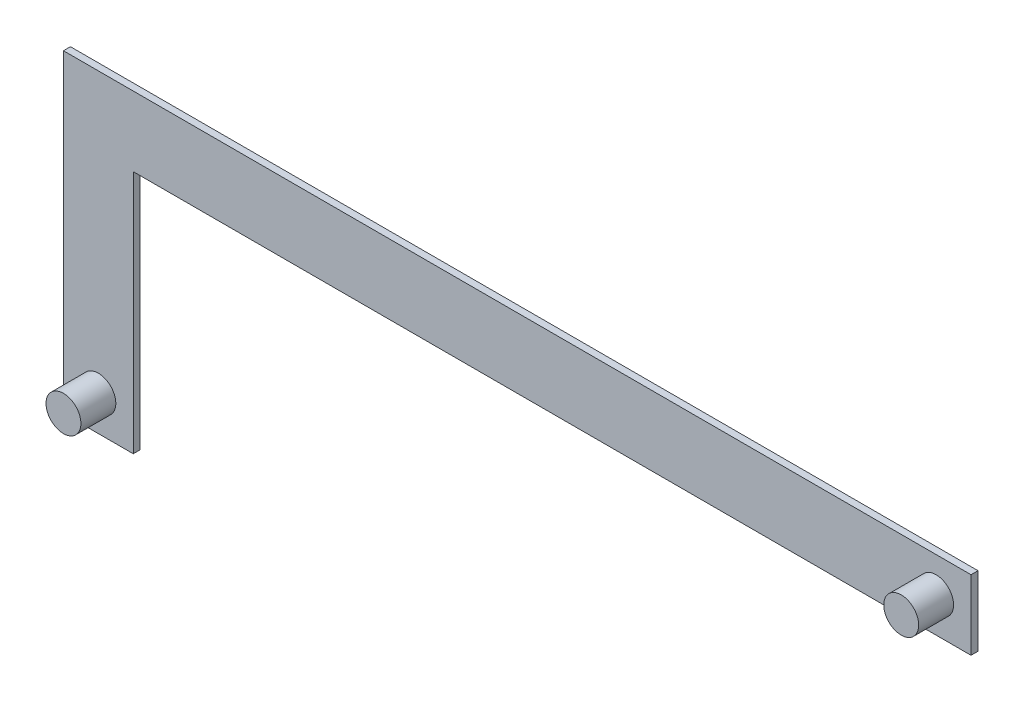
ISO-10303-21;
HEADER;
FILE_DESCRIPTION(('STEP AP214'),'2;1');
FILE_NAME('part.step','',(''),(''),'','','');
FILE_SCHEMA(('AUTOMOTIVE_DESIGN { 1 0 10303 214 1 1 1 1 }'));
ENDSEC;
DATA;
#1=APPLICATION_CONTEXT('core data for automotive mechanical design processes');
#2=APPLICATION_PROTOCOL_DEFINITION('international standard','automotive_design',2000,#1);
#3=PRODUCT_CONTEXT('',#1,'mechanical');
#4=PRODUCT('Part','Part','',(#3));
#5=PRODUCT_RELATED_PRODUCT_CATEGORY('part','',(#4));
#6=PRODUCT_DEFINITION_FORMATION('','',#4);
#7=PRODUCT_DEFINITION_CONTEXT('part definition',#1,'design');
#8=PRODUCT_DEFINITION('design','',#6,#7);
#9=PRODUCT_DEFINITION_SHAPE('','',#8);
#10=(LENGTH_UNIT() NAMED_UNIT(*) SI_UNIT(.MILLI.,.METRE.));
#11=(NAMED_UNIT(*) PLANE_ANGLE_UNIT() SI_UNIT($,.RADIAN.));
#12=(NAMED_UNIT(*) SI_UNIT($,.STERADIAN.) SOLID_ANGLE_UNIT());
#13=UNCERTAINTY_MEASURE_WITH_UNIT(LENGTH_MEASURE(1.E-05),#10,'distance_accuracy_value','');
#14=(GEOMETRIC_REPRESENTATION_CONTEXT(3) GLOBAL_UNCERTAINTY_ASSIGNED_CONTEXT((#13)) GLOBAL_UNIT_ASSIGNED_CONTEXT((#10,
#11,#12)) REPRESENTATION_CONTEXT('',''));
#15=CARTESIAN_POINT('',(0.,0.,0.));
#16=DIRECTION('',(0.,0.,1.));
#17=DIRECTION('',(1.,0.,0.));
#18=AXIS2_PLACEMENT_3D('',#15,#16,#17);
#19=CARTESIAN_POINT('',(125.,-5.,0.));
#20=DIRECTION('',(0.,0.,-1.));
#21=DIRECTION('',(-1.,0.,0.));
#22=AXIS2_PLACEMENT_3D('',#19,#20,#21);
#23=PLANE('',#22);
#24=CARTESIAN_POINT('',(0.,0.,0.));
#25=DIRECTION('',(0.,0.,-1.));
#26=DIRECTION('',(-1.,0.,0.));
#27=AXIS2_PLACEMENT_3D('',#24,#25,#26);
#28=CIRCLE('',#27,2.5);
#29=CARTESIAN_POINT('',(-2.5,0.,0.));
#30=VERTEX_POINT('',#29);
#31=EDGE_CURVE('E101',#30,#30,#28,.T.);
#32=ORIENTED_EDGE('',*,*,#31,.T.);
#33=EDGE_LOOP('',(#32));
#34=FACE_BOUND('',#33,.T.);
#35=DIRECTION('',(0.,-1.,0.));
#36=VECTOR('',#35,1.);
#37=CARTESIAN_POINT('',(125.,40.,0.));
#38=LINE('',#37,#36);
#39=CARTESIAN_POINT('',(125.,40.,0.));
#40=VERTEX_POINT('',#39);
#41=CARTESIAN_POINT('',(125.,30.,0.));
#42=VERTEX_POINT('',#41);
#43=EDGE_CURVE('E88',#40,#42,#38,.T.);
#44=ORIENTED_EDGE('',*,*,#43,.F.);
#45=DIRECTION('',(1.,0.,0.));
#46=VECTOR('',#45,1.);
#47=CARTESIAN_POINT('',(125.,40.,0.));
#48=LINE('',#47,#46);
#49=CARTESIAN_POINT('',(-5.,40.,0.));
#50=VERTEX_POINT('',#49);
#51=EDGE_CURVE('E117',#50,#40,#48,.T.);
#52=ORIENTED_EDGE('',*,*,#51,.F.);
#53=DIRECTION('',(0.,1.,0.));
#54=VECTOR('',#53,1.);
#55=CARTESIAN_POINT('',(-5.,40.,0.));
#56=LINE('',#55,#54);
#57=CARTESIAN_POINT('',(-5.,-5.,0.));
#58=VERTEX_POINT('',#57);
#59=EDGE_CURVE('E115',#58,#50,#56,.T.);
#60=ORIENTED_EDGE('',*,*,#59,.F.);
#61=DIRECTION('',(-1.,0.,0.));
#62=VECTOR('',#61,1.);
#63=CARTESIAN_POINT('',(5.,-5.,0.));
#64=LINE('',#63,#62);
#65=CARTESIAN_POINT('',(5.,-5.,0.));
#66=VERTEX_POINT('',#65);
#67=EDGE_CURVE('E113',#66,#58,#64,.T.);
#68=ORIENTED_EDGE('',*,*,#67,.F.);
#69=DIRECTION('',(0.,-1.,0.));
#70=VECTOR('',#69,1.);
#71=CARTESIAN_POINT('',(5.,-5.,0.));
#72=LINE('',#71,#70);
#73=CARTESIAN_POINT('',(5.00000000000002,30.,0.));
#74=VERTEX_POINT('',#73);
#75=EDGE_CURVE('E90',#74,#66,#72,.T.);
#76=ORIENTED_EDGE('',*,*,#75,.F.);
#77=DIRECTION('',(-1.,0.,0.));
#78=VECTOR('',#77,1.);
#79=CARTESIAN_POINT('',(125.,30.,0.));
#80=LINE('',#79,#78);
#81=EDGE_CURVE('E83',#42,#74,#80,.T.);
#82=ORIENTED_EDGE('',*,*,#81,.F.);
#83=EDGE_LOOP('',(#44,#52,#60,#68,#76,#82));
#84=FACE_BOUND('',#83,.T.);
#85=CARTESIAN_POINT('',(120.,35.,0.));
#86=DIRECTION('',(0.,0.,-1.));
#87=DIRECTION('',(-1.,0.,0.));
#88=AXIS2_PLACEMENT_3D('',#85,#86,#87);
#89=CIRCLE('',#88,2.50000000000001);
#90=CARTESIAN_POINT('',(117.5,35.,0.));
#91=VERTEX_POINT('',#90);
#92=EDGE_CURVE('E11',#91,#91,#89,.F.);
#93=ORIENTED_EDGE('',*,*,#92,.F.);
#94=EDGE_LOOP('',(#93));
#95=FACE_BOUND('',#94,.T.);
#96=ADVANCED_FACE('F30',(#34,#84,#95),#23,.F.);
#97=CARTESIAN_POINT('',(0.,0.,5.));
#98=DIRECTION('',(0.,0.,-1.));
#99=DIRECTION('',(-1.,0.,0.));
#100=AXIS2_PLACEMENT_3D('',#97,#98,#99);
#101=CYLINDRICAL_SURFACE('',#100,2.5);
#102=CARTESIAN_POINT('',(0.,0.,5.));
#103=DIRECTION('',(0.,0.,1.));
#104=DIRECTION('',(1.,0.,0.));
#105=AXIS2_PLACEMENT_3D('',#102,#103,#104);
#106=CIRCLE('',#105,2.5);
#107=CARTESIAN_POINT('',(2.5,0.,5.));
#108=VERTEX_POINT('',#107);
#109=EDGE_CURVE('E38',#108,#108,#106,.T.);
#110=ORIENTED_EDGE('',*,*,#109,.F.);
#111=EDGE_LOOP('',(#110));
#112=FACE_BOUND('',#111,.T.);
#113=ORIENTED_EDGE('',*,*,#31,.F.);
#114=EDGE_LOOP('',(#113));
#115=FACE_BOUND('',#114,.T.);
#116=ADVANCED_FACE('F32',(#112,#115),#101,.T.);
#117=CARTESIAN_POINT('',(0.,0.,5.));
#118=DIRECTION('',(0.,0.,1.));
#119=DIRECTION('',(1.,0.,0.));
#120=AXIS2_PLACEMENT_3D('',#117,#118,#119);
#121=PLANE('',#120);
#122=ORIENTED_EDGE('',*,*,#109,.T.);
#123=EDGE_LOOP('',(#122));
#124=FACE_BOUND('',#123,.T.);
#125=ADVANCED_FACE('F143',(#124),#121,.T.);
#126=CARTESIAN_POINT('',(125.,40.,-1.));
#127=DIRECTION('',(-1.,0.,0.));
#128=DIRECTION('',(0.,0.,1.));
#129=AXIS2_PLACEMENT_3D('',#126,#127,#128);
#130=PLANE('',#129);
#131=ORIENTED_EDGE('',*,*,#43,.T.);
#132=DIRECTION('',(0.,0.,1.));
#133=VECTOR('',#132,1.);
#134=CARTESIAN_POINT('',(125.,30.,-1.));
#135=LINE('',#134,#133);
#136=CARTESIAN_POINT('',(125.,30.,-1.));
#137=VERTEX_POINT('',#136);
#138=EDGE_CURVE('E96',#137,#42,#135,.T.);
#139=ORIENTED_EDGE('',*,*,#138,.F.);
#140=DIRECTION('',(0.,-1.,0.));
#141=VECTOR('',#140,1.);
#142=CARTESIAN_POINT('',(125.,40.,-1.));
#143=LINE('',#142,#141);
#144=CARTESIAN_POINT('',(125.,40.,-1.));
#145=VERTEX_POINT('',#144);
#146=EDGE_CURVE('E119',#145,#137,#143,.T.);
#147=ORIENTED_EDGE('',*,*,#146,.F.);
#148=DIRECTION('',(0.,0.,1.));
#149=VECTOR('',#148,1.);
#150=CARTESIAN_POINT('',(125.,40.,-1.));
#151=LINE('',#150,#149);
#152=EDGE_CURVE('E106',#145,#40,#151,.T.);
#153=ORIENTED_EDGE('',*,*,#152,.T.);
#154=EDGE_LOOP('',(#131,#139,#147,#153));
#155=FACE_BOUND('',#154,.T.);
#156=ADVANCED_FACE('F105',(#155),#130,.F.);
#157=CARTESIAN_POINT('',(125.,30.,-1.));
#158=DIRECTION('',(0.,1.,0.));
#159=DIRECTION('',(-1.,0.,0.));
#160=AXIS2_PLACEMENT_3D('',#157,#158,#159);
#161=PLANE('',#160);
#162=ORIENTED_EDGE('',*,*,#81,.T.);
#163=DIRECTION('',(0.,0.,1.));
#164=VECTOR('',#163,1.);
#165=CARTESIAN_POINT('',(5.00000000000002,30.,-1.));
#166=LINE('',#165,#164);
#167=CARTESIAN_POINT('',(5.00000000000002,30.,-1.));
#168=VERTEX_POINT('',#167);
#169=EDGE_CURVE('E102',#168,#74,#166,.T.);
#170=ORIENTED_EDGE('',*,*,#169,.F.);
#171=DIRECTION('',(-1.,0.,0.));
#172=VECTOR('',#171,1.);
#173=CARTESIAN_POINT('',(125.,30.,-1.));
#174=LINE('',#173,#172);
#175=EDGE_CURVE('E98',#137,#168,#174,.T.);
#176=ORIENTED_EDGE('',*,*,#175,.F.);
#177=ORIENTED_EDGE('',*,*,#138,.T.);
#178=EDGE_LOOP('',(#162,#170,#176,#177));
#179=FACE_BOUND('',#178,.T.);
#180=ADVANCED_FACE('F97',(#179),#161,.F.);
#181=CARTESIAN_POINT('',(5.,-5.,-1.));
#182=DIRECTION('',(-1.,0.,0.));
#183=DIRECTION('',(0.,-1.,0.));
#184=AXIS2_PLACEMENT_3D('',#181,#182,#183);
#185=PLANE('',#184);
#186=ORIENTED_EDGE('',*,*,#75,.T.);
#187=DIRECTION('',(0.,0.,1.));
#188=VECTOR('',#187,1.);
#189=CARTESIAN_POINT('',(5.,-5.,-1.));
#190=LINE('',#189,#188);
#191=CARTESIAN_POINT('',(5.,-5.,-1.));
#192=VERTEX_POINT('',#191);
#193=EDGE_CURVE('E135',#192,#66,#190,.T.);
#194=ORIENTED_EDGE('',*,*,#193,.F.);
#195=DIRECTION('',(0.,-1.,0.));
#196=VECTOR('',#195,1.);
#197=CARTESIAN_POINT('',(5.,-5.,-1.));
#198=LINE('',#197,#196);
#199=EDGE_CURVE('E122',#168,#192,#198,.T.);
#200=ORIENTED_EDGE('',*,*,#199,.F.);
#201=ORIENTED_EDGE('',*,*,#169,.T.);
#202=EDGE_LOOP('',(#186,#194,#200,#201));
#203=FACE_BOUND('',#202,.T.);
#204=ADVANCED_FACE('F171',(#203),#185,.F.);
#205=CARTESIAN_POINT('',(5.,-5.,-1.));
#206=DIRECTION('',(0.,1.,0.));
#207=DIRECTION('',(0.,0.,1.));
#208=AXIS2_PLACEMENT_3D('',#205,#206,#207);
#209=PLANE('',#208);
#210=ORIENTED_EDGE('',*,*,#67,.T.);
#211=DIRECTION('',(0.,0.,1.));
#212=VECTOR('',#211,1.);
#213=CARTESIAN_POINT('',(-5.,-5.,-1.));
#214=LINE('',#213,#212);
#215=CARTESIAN_POINT('',(-5.,-5.,-1.));
#216=VERTEX_POINT('',#215);
#217=EDGE_CURVE('E132',#216,#58,#214,.T.);
#218=ORIENTED_EDGE('',*,*,#217,.F.);
#219=DIRECTION('',(-1.,0.,0.));
#220=VECTOR('',#219,1.);
#221=CARTESIAN_POINT('',(5.,-5.,-1.));
#222=LINE('',#221,#220);
#223=EDGE_CURVE('E124',#192,#216,#222,.T.);
#224=ORIENTED_EDGE('',*,*,#223,.F.);
#225=ORIENTED_EDGE('',*,*,#193,.T.);
#226=EDGE_LOOP('',(#210,#218,#224,#225));
#227=FACE_BOUND('',#226,.T.);
#228=ADVANCED_FACE('F167',(#227),#209,.F.);
#229=CARTESIAN_POINT('',(-5.,40.,-1.));
#230=DIRECTION('',(1.,0.,0.));
#231=DIRECTION('',(0.,0.,-1.));
#232=AXIS2_PLACEMENT_3D('',#229,#230,#231);
#233=PLANE('',#232);
#234=ORIENTED_EDGE('',*,*,#59,.T.);
#235=DIRECTION('',(0.,0.,1.));
#236=VECTOR('',#235,1.);
#237=CARTESIAN_POINT('',(-5.,40.,-1.));
#238=LINE('',#237,#236);
#239=CARTESIAN_POINT('',(-5.,40.,-1.));
#240=VERTEX_POINT('',#239);
#241=EDGE_CURVE('E129',#240,#50,#238,.T.);
#242=ORIENTED_EDGE('',*,*,#241,.F.);
#243=DIRECTION('',(0.,1.,0.));
#244=VECTOR('',#243,1.);
#245=CARTESIAN_POINT('',(-5.,40.,-1.));
#246=LINE('',#245,#244);
#247=EDGE_CURVE('E50',#216,#240,#246,.T.);
#248=ORIENTED_EDGE('',*,*,#247,.F.);
#249=ORIENTED_EDGE('',*,*,#217,.T.);
#250=EDGE_LOOP('',(#234,#242,#248,#249));
#251=FACE_BOUND('',#250,.T.);
#252=ADVANCED_FACE('F163',(#251),#233,.F.);
#253=CARTESIAN_POINT('',(125.,40.,-1.));
#254=DIRECTION('',(0.,-1.,0.));
#255=DIRECTION('',(1.,0.,0.));
#256=AXIS2_PLACEMENT_3D('',#253,#254,#255);
#257=PLANE('',#256);
#258=ORIENTED_EDGE('',*,*,#51,.T.);
#259=ORIENTED_EDGE('',*,*,#152,.F.);
#260=DIRECTION('',(1.,0.,0.));
#261=VECTOR('',#260,1.);
#262=CARTESIAN_POINT('',(125.,40.,-1.));
#263=LINE('',#262,#261);
#264=EDGE_CURVE('E45',#240,#145,#263,.T.);
#265=ORIENTED_EDGE('',*,*,#264,.F.);
#266=ORIENTED_EDGE('',*,*,#241,.T.);
#267=EDGE_LOOP('',(#258,#259,#265,#266));
#268=FACE_BOUND('',#267,.T.);
#269=ADVANCED_FACE('F160',(#268),#257,.F.);
#270=CARTESIAN_POINT('',(125.,-5.,-1.));
#271=DIRECTION('',(0.,0.,-1.));
#272=DIRECTION('',(-1.,0.,0.));
#273=AXIS2_PLACEMENT_3D('',#270,#271,#272);
#274=PLANE('',#273);
#275=ORIENTED_EDGE('',*,*,#146,.T.);
#276=ORIENTED_EDGE('',*,*,#175,.T.);
#277=ORIENTED_EDGE('',*,*,#199,.T.);
#278=ORIENTED_EDGE('',*,*,#223,.T.);
#279=ORIENTED_EDGE('',*,*,#247,.T.);
#280=ORIENTED_EDGE('',*,*,#264,.T.);
#281=EDGE_LOOP('',(#275,#276,#277,#278,#279,#280));
#282=FACE_BOUND('',#281,.T.);
#283=ADVANCED_FACE('F157',(#282),#274,.T.);
#284=CARTESIAN_POINT('',(120.,35.,5.));
#285=DIRECTION('',(0.,0.,-1.));
#286=DIRECTION('',(-1.,0.,0.));
#287=AXIS2_PLACEMENT_3D('',#284,#285,#286);
#288=CYLINDRICAL_SURFACE('',#287,2.50000000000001);
#289=CARTESIAN_POINT('',(120.,35.,5.));
#290=DIRECTION('',(0.,0.,1.));
#291=DIRECTION('',(1.,0.,0.));
#292=AXIS2_PLACEMENT_3D('',#289,#290,#291);
#293=CIRCLE('',#292,2.50000000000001);
#294=CARTESIAN_POINT('',(122.5,35.,5.));
#295=VERTEX_POINT('',#294);
#296=EDGE_CURVE('E107',#295,#295,#293,.T.);
#297=ORIENTED_EDGE('',*,*,#296,.F.);
#298=EDGE_LOOP('',(#297));
#299=FACE_BOUND('',#298,.T.);
#300=ORIENTED_EDGE('',*,*,#92,.T.);
#301=EDGE_LOOP('',(#300));
#302=FACE_BOUND('',#301,.T.);
#303=ADVANCED_FACE('F155',(#299,#302),#288,.T.);
#304=CARTESIAN_POINT('',(120.,35.,5.));
#305=DIRECTION('',(0.,0.,1.));
#306=DIRECTION('',(1.,0.,0.));
#307=AXIS2_PLACEMENT_3D('',#304,#305,#306);
#308=PLANE('',#307);
#309=ORIENTED_EDGE('',*,*,#296,.T.);
#310=EDGE_LOOP('',(#309));
#311=FACE_BOUND('',#310,.T.);
#312=ADVANCED_FACE('F218',(#311),#308,.T.);
#313=CLOSED_SHELL('',(#96,#116,#125,#156,#180,#204,#228,#252,#269,#283,#303,#312));
#314=MANIFOLD_SOLID_BREP('B2',#313);
#315=ADVANCED_BREP_SHAPE_REPRESENTATION('',(#18,#314),#14);
#316=SHAPE_DEFINITION_REPRESENTATION(#9,#315);
ENDSEC;
END-ISO-10303-21;
